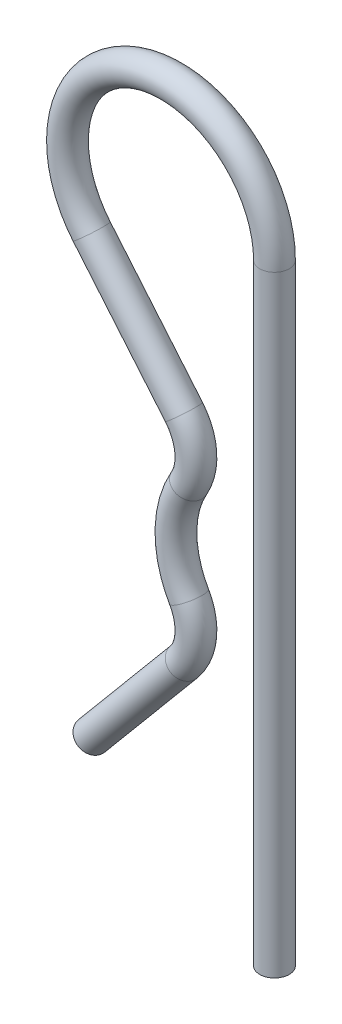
ISO-10303-21;
HEADER;
FILE_DESCRIPTION(('STEP AP214'),'2;1');
FILE_NAME('part.step','',(''),(''),'','','');
FILE_SCHEMA(('AUTOMOTIVE_DESIGN { 1 0 10303 214 1 1 1 1 }'));
ENDSEC;
DATA;
#1=APPLICATION_CONTEXT('core data for automotive mechanical design processes');
#2=APPLICATION_PROTOCOL_DEFINITION('international standard','automotive_design',2000,#1);
#3=PRODUCT_CONTEXT('',#1,'mechanical');
#4=PRODUCT('Part','Part','',(#3));
#5=PRODUCT_RELATED_PRODUCT_CATEGORY('part','',(#4));
#6=PRODUCT_DEFINITION_FORMATION('','',#4);
#7=PRODUCT_DEFINITION_CONTEXT('part definition',#1,'design');
#8=PRODUCT_DEFINITION('design','',#6,#7);
#9=PRODUCT_DEFINITION_SHAPE('','',#8);
#10=(LENGTH_UNIT() NAMED_UNIT(*) SI_UNIT(.MILLI.,.METRE.));
#11=(NAMED_UNIT(*) PLANE_ANGLE_UNIT() SI_UNIT($,.RADIAN.));
#12=(NAMED_UNIT(*) SI_UNIT($,.STERADIAN.) SOLID_ANGLE_UNIT());
#13=UNCERTAINTY_MEASURE_WITH_UNIT(LENGTH_MEASURE(1.E-05),#10,'distance_accuracy_value','');
#14=(GEOMETRIC_REPRESENTATION_CONTEXT(3) GLOBAL_UNCERTAINTY_ASSIGNED_CONTEXT((#13)) GLOBAL_UNIT_ASSIGNED_CONTEXT((#10,
#11,#12)) REPRESENTATION_CONTEXT('',''));
#15=CARTESIAN_POINT('',(0.,0.,0.));
#16=DIRECTION('',(0.,0.,1.));
#17=DIRECTION('',(1.,0.,0.));
#18=AXIS2_PLACEMENT_3D('',#15,#16,#17);
#19=CARTESIAN_POINT('',(-4.59515832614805,-5.48949177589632,0.));
#20=DIRECTION('',(-0.641879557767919,-0.766805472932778,0.));
#21=DIRECTION('',(0.766805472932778,-0.641879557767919,0.));
#22=AXIS2_PLACEMENT_3D('',#19,#20,#21);
#23=CYLINDRICAL_SURFACE('',#22,0.75);
#24=CARTESIAN_POINT('',(-4.59515832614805,-5.48949177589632,0.));
#25=DIRECTION('',(-0.64187955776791,-0.766805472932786,0.));
#26=DIRECTION('',(0.,0.,1.));
#27=AXIS2_PLACEMENT_3D('',#24,#25,#26);
#28=CIRCLE('',#27,0.75);
#29=CARTESIAN_POINT('',(-4.02005422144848,-5.97090144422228,0.));
#30=VERTEX_POINT('',#29);
#31=EDGE_CURVE('E30',#30,#30,#28,.T.);
#32=ORIENTED_EDGE('',*,*,#31,.T.);
#33=EDGE_LOOP('',(#32));
#34=FACE_BOUND('',#33,.T.);
#35=CARTESIAN_POINT('',(-9.27572873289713,-11.0810189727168,0.));
#36=DIRECTION('',(-0.64187955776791,-0.766805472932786,0.));
#37=DIRECTION('',(0.,0.,1.));
#38=AXIS2_PLACEMENT_3D('',#35,#36,#37);
#39=CIRCLE('',#38,0.75);
#40=CARTESIAN_POINT('',(-9.27572873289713,-11.0810189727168,0.75));
#41=VERTEX_POINT('',#40);
#42=EDGE_CURVE('E10',#41,#41,#39,.T.);
#43=ORIENTED_EDGE('',*,*,#42,.F.);
#44=EDGE_LOOP('',(#43));
#45=FACE_BOUND('',#44,.T.);
#46=ADVANCED_FACE('F24',(#34,#45),#23,.T.);
#47=CARTESIAN_POINT('',(-6.60802269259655,-3.80455793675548,0.));
#48=DIRECTION('',(0.,0.,-1.));
#49=DIRECTION('',(-1.,0.,0.));
#50=AXIS2_PLACEMENT_3D('',#47,#48,#49);
#51=TOROIDAL_SURFACE('',#50,2.625,0.75);
#52=CARTESIAN_POINT('',(-4.3331296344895,-2.49479208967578,0.));
#53=DIRECTION('',(0.498958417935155,-0.866625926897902,0.));
#54=DIRECTION('',(0.,0.,1.));
#55=AXIS2_PLACEMENT_3D('',#52,#53,#54);
#56=CIRCLE('',#55,0.75);
#57=CARTESIAN_POINT('',(-3.68316018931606,-2.12057327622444,0.));
#58=VERTEX_POINT('',#57);
#59=EDGE_CURVE('E34',#58,#58,#56,.T.);
#60=CARTESIAN_POINT('',(-6.60802269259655,-3.80455793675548,0.));
#61=DIRECTION('',(0.,0.,-1.));
#62=DIRECTION('',(-1.,0.,0.));
#63=AXIS2_PLACEMENT_3D('',#60,#61,#62);
#64=CIRCLE('',#63,3.375);
#65=EDGE_CURVE('',#58,#30,#64,.T.);
#66=ORIENTED_EDGE('',*,*,#59,.T.);
#67=ORIENTED_EDGE('',*,*,#31,.F.);
#68=ORIENTED_EDGE('',*,*,#65,.T.);
#69=ORIENTED_EDGE('',*,*,#65,.F.);
#70=EDGE_LOOP('',(#66,#68,#67,#69));
#71=FACE_BOUND('',#70,.T.);
#72=ADVANCED_FACE('F67',(#71),#51,.T.);
#73=CARTESIAN_POINT('',(0.,0.,0.));
#74=DIRECTION('',(0.,0.,1.));
#75=DIRECTION('',(1.,0.,0.));
#76=AXIS2_PLACEMENT_3D('',#73,#74,#75);
#77=TOROIDAL_SURFACE('',#76,5.,0.75);
#78=CARTESIAN_POINT('',(-4.33312963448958,2.49479208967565,0.));
#79=DIRECTION('',(-0.498958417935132,-0.866625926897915,0.));
#80=DIRECTION('',(0.,0.,1.));
#81=AXIS2_PLACEMENT_3D('',#78,#79,#80);
#82=CIRCLE('',#81,0.75);
#83=CARTESIAN_POINT('',(-3.68316018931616,2.12057327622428,0.));
#84=VERTEX_POINT('',#83);
#85=EDGE_CURVE('E38',#84,#84,#82,.T.);
#86=ORIENTED_EDGE('',*,*,#85,.T.);
#87=EDGE_LOOP('',(#86));
#88=FACE_BOUND('',#87,.T.);
#89=ORIENTED_EDGE('',*,*,#59,.F.);
#90=EDGE_LOOP('',(#89));
#91=FACE_BOUND('',#90,.T.);
#92=ADVANCED_FACE('F71',(#88,#91),#77,.T.);
#93=CARTESIAN_POINT('',(-6.60802269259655,3.80455793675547,0.));
#94=DIRECTION('',(0.,0.,-1.));
#95=DIRECTION('',(-1.,0.,0.));
#96=AXIS2_PLACEMENT_3D('',#93,#94,#95);
#97=TOROIDAL_SURFACE('',#96,2.625,0.75);
#98=CARTESIAN_POINT('',(-4.59515832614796,5.4894917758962,0.));
#99=DIRECTION('',(0.641879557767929,-0.766805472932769,0.));
#100=DIRECTION('',(0.,0.,1.));
#101=AXIS2_PLACEMENT_3D('',#98,#99,#100);
#102=CIRCLE('',#101,0.75);
#103=CARTESIAN_POINT('',(-4.02005422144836,5.97090144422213,0.));
#104=VERTEX_POINT('',#103);
#105=EDGE_CURVE('E43',#104,#104,#102,.T.);
#106=CARTESIAN_POINT('',(-6.60802269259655,3.80455793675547,0.));
#107=DIRECTION('',(0.,0.,-1.));
#108=DIRECTION('',(-1.,0.,0.));
#109=AXIS2_PLACEMENT_3D('',#106,#107,#108);
#110=CIRCLE('',#109,3.375);
#111=EDGE_CURVE('',#104,#84,#110,.T.);
#112=ORIENTED_EDGE('',*,*,#105,.T.);
#113=ORIENTED_EDGE('',*,*,#85,.F.);
#114=ORIENTED_EDGE('',*,*,#111,.T.);
#115=ORIENTED_EDGE('',*,*,#111,.F.);
#116=EDGE_LOOP('',(#112,#114,#113,#115));
#117=FACE_BOUND('',#116,.T.);
#118=ADVANCED_FACE('F77',(#117),#97,.T.);
#119=CARTESIAN_POINT('',(-9.27572873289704,11.0810189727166,0.));
#120=DIRECTION('',(0.641879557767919,-0.766805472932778,0.));
#121=DIRECTION('',(0.766805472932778,0.641879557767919,0.));
#122=AXIS2_PLACEMENT_3D('',#119,#120,#121);
#123=CYLINDRICAL_SURFACE('',#122,0.75);
#124=CARTESIAN_POINT('',(-9.27572873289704,11.0810189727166,0.));
#125=DIRECTION('',(0.641879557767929,-0.766805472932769,0.));
#126=DIRECTION('',(0.,0.,1.));
#127=AXIS2_PLACEMENT_3D('',#124,#125,#126);
#128=CIRCLE('',#127,0.75);
#129=CARTESIAN_POINT('',(-9.85083283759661,10.5996093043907,0.));
#130=VERTEX_POINT('',#129);
#131=EDGE_CURVE('E46',#130,#130,#128,.T.);
#132=ORIENTED_EDGE('',*,*,#131,.T.);
#133=EDGE_LOOP('',(#132));
#134=FACE_BOUND('',#133,.T.);
#135=ORIENTED_EDGE('',*,*,#105,.F.);
#136=EDGE_LOOP('',(#135));
#137=FACE_BOUND('',#136,.T.);
#138=ADVANCED_FACE('F84',(#134,#137),#123,.T.);
#139=CARTESIAN_POINT('',(-5.25,14.4508866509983,0.));
#140=DIRECTION('',(0.,0.,1.));
#141=DIRECTION('',(1.,0.,0.));
#142=AXIS2_PLACEMENT_3D('',#139,#140,#141);
#143=TOROIDAL_SURFACE('',#142,5.25,0.75);
#144=CARTESIAN_POINT('',(0.,14.4508866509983,0.));
#145=DIRECTION('',(0.,1.,0.));
#146=DIRECTION('',(0.,0.,1.));
#147=AXIS2_PLACEMENT_3D('',#144,#145,#146);
#148=CIRCLE('',#147,0.75);
#149=CARTESIAN_POINT('',(0.749999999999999,14.4508866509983,0.));
#150=VERTEX_POINT('',#149);
#151=EDGE_CURVE('E49',#150,#150,#148,.T.);
#152=CARTESIAN_POINT('',(-5.25,14.4508866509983,0.));
#153=DIRECTION('',(0.,0.,1.));
#154=DIRECTION('',(1.,0.,0.));
#155=AXIS2_PLACEMENT_3D('',#152,#153,#154);
#156=CIRCLE('',#155,6.);
#157=EDGE_CURVE('',#150,#130,#156,.T.);
#158=ORIENTED_EDGE('',*,*,#151,.T.);
#159=ORIENTED_EDGE('',*,*,#131,.F.);
#160=ORIENTED_EDGE('',*,*,#157,.T.);
#161=ORIENTED_EDGE('',*,*,#157,.F.);
#162=EDGE_LOOP('',(#158,#160,#159,#161));
#163=FACE_BOUND('',#162,.T.);
#164=ADVANCED_FACE('F88',(#163),#143,.T.);
#165=CARTESIAN_POINT('',(0.,14.4508866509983,0.));
#166=DIRECTION('',(0.,-1.,0.));
#167=DIRECTION('',(1.,0.,0.));
#168=AXIS2_PLACEMENT_3D('',#165,#166,#167);
#169=CYLINDRICAL_SURFACE('',#168,0.75);
#170=ORIENTED_EDGE('',*,*,#151,.F.);
#171=EDGE_LOOP('',(#170));
#172=FACE_BOUND('',#171,.T.);
#173=CARTESIAN_POINT('',(0.,-16.5491133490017,0.));
#174=DIRECTION('',(0.,1.,0.));
#175=DIRECTION('',(0.,0.,1.));
#176=AXIS2_PLACEMENT_3D('',#173,#174,#175);
#177=CIRCLE('',#176,0.75);
#178=CARTESIAN_POINT('',(0.,-16.5491133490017,0.75));
#179=VERTEX_POINT('',#178);
#180=EDGE_CURVE('E52',#179,#179,#177,.T.);
#181=ORIENTED_EDGE('',*,*,#180,.T.);
#182=EDGE_LOOP('',(#181));
#183=FACE_BOUND('',#182,.T.);
#184=ADVANCED_FACE('F56',(#172,#183),#169,.T.);
#185=CARTESIAN_POINT('',(-9.27572873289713,-11.0810189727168,0.));
#186=DIRECTION('',(-0.64187955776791,-0.766805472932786,0.));
#187=DIRECTION('',(0.,0.,1.));
#188=AXIS2_PLACEMENT_3D('',#185,#186,#187);
#189=PLANE('',#188);
#190=ORIENTED_EDGE('',*,*,#42,.T.);
#191=EDGE_LOOP('',(#190));
#192=FACE_BOUND('',#191,.T.);
#193=ADVANCED_FACE('F60',(#192),#189,.T.);
#194=CARTESIAN_POINT('',(0.,-16.5491133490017,0.));
#195=DIRECTION('',(0.,1.,0.));
#196=DIRECTION('',(0.,0.,1.));
#197=AXIS2_PLACEMENT_3D('',#194,#195,#196);
#198=PLANE('',#197);
#199=ORIENTED_EDGE('',*,*,#180,.F.);
#200=EDGE_LOOP('',(#199));
#201=FACE_BOUND('',#200,.T.);
#202=ADVANCED_FACE('F58',(#201),#198,.F.);
#203=CLOSED_SHELL('',(#46,#72,#92,#118,#138,#164,#184,#193,#202));
#204=MANIFOLD_SOLID_BREP('B2',#203);
#205=ADVANCED_BREP_SHAPE_REPRESENTATION('',(#18,#204),#14);
#206=SHAPE_DEFINITION_REPRESENTATION(#9,#205);
ENDSEC;
END-ISO-10303-21;
